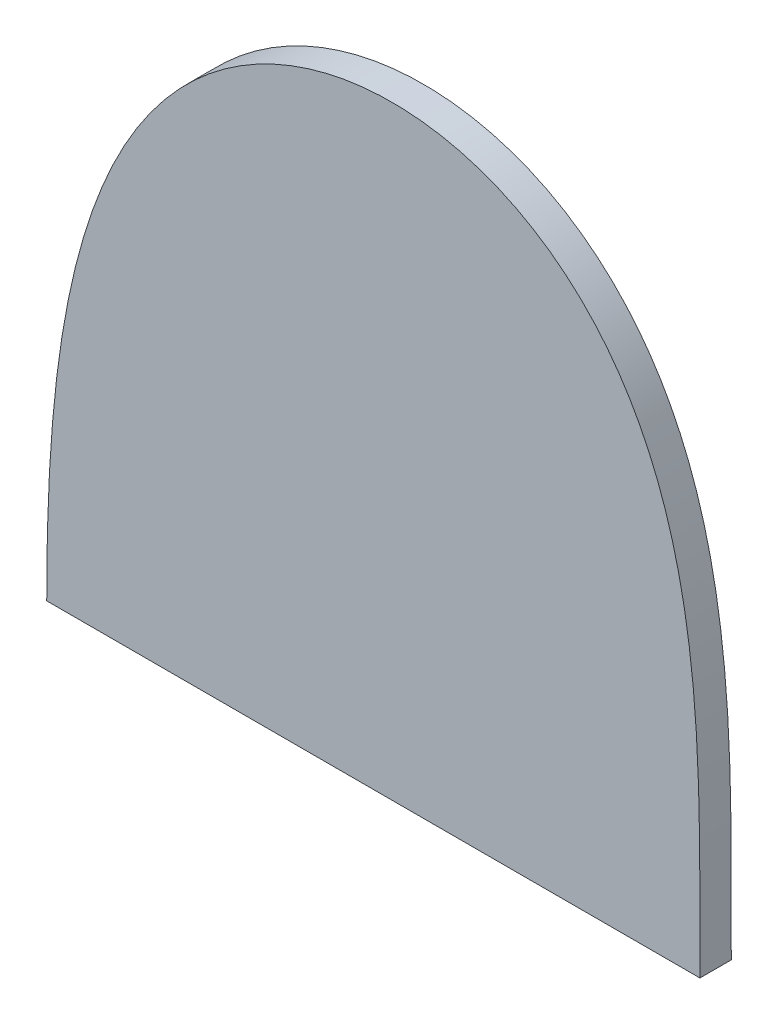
ISO-10303-21;
HEADER;
FILE_DESCRIPTION(('STEP AP214'),'2;1');
FILE_NAME('part.step','',(''),(''),'','','');
FILE_SCHEMA(('AUTOMOTIVE_DESIGN { 1 0 10303 214 1 1 1 1 }'));
ENDSEC;
DATA;
#1=APPLICATION_CONTEXT('core data for automotive mechanical design processes');
#2=APPLICATION_PROTOCOL_DEFINITION('international standard','automotive_design',2000,#1);
#3=PRODUCT_CONTEXT('',#1,'mechanical');
#4=PRODUCT('Part','Part','',(#3));
#5=PRODUCT_RELATED_PRODUCT_CATEGORY('part','',(#4));
#6=PRODUCT_DEFINITION_FORMATION('','',#4);
#7=PRODUCT_DEFINITION_CONTEXT('part definition',#1,'design');
#8=PRODUCT_DEFINITION('design','',#6,#7);
#9=PRODUCT_DEFINITION_SHAPE('','',#8);
#10=(LENGTH_UNIT() NAMED_UNIT(*) SI_UNIT(.MILLI.,.METRE.));
#11=(NAMED_UNIT(*) PLANE_ANGLE_UNIT() SI_UNIT($,.RADIAN.));
#12=(NAMED_UNIT(*) SI_UNIT($,.STERADIAN.) SOLID_ANGLE_UNIT());
#13=UNCERTAINTY_MEASURE_WITH_UNIT(LENGTH_MEASURE(1.E-05),#10,'distance_accuracy_value','');
#14=(GEOMETRIC_REPRESENTATION_CONTEXT(3) GLOBAL_UNCERTAINTY_ASSIGNED_CONTEXT((#13)) GLOBAL_UNIT_ASSIGNED_CONTEXT((#10,
#11,#12)) REPRESENTATION_CONTEXT('',''));
#15=CARTESIAN_POINT('',(0.,0.,0.));
#16=DIRECTION('',(0.,0.,1.));
#17=DIRECTION('',(1.,0.,0.));
#18=AXIS2_PLACEMENT_3D('',#15,#16,#17);
#19=CARTESIAN_POINT('',(19.1800983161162,5.17745356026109,-0.914397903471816));
#20=CARTESIAN_POINT('',(19.1800983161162,12.7102458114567,-0.914397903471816));
#21=CARTESIAN_POINT('',(19.5484411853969,17.6422006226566,-0.914397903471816));
#22=CARTESIAN_POINT('',(12.8300983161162,19.5715823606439,-0.914397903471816));
#23=CARTESIAN_POINT('',(7.67253765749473,17.6422006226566,-0.914397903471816));
#24=CARTESIAN_POINT('',(6.48009831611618,12.7102458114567,-0.914397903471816));
#25=CARTESIAN_POINT('',(6.48009831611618,5.17745356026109,-0.914397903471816));
#26=B_SPLINE_CURVE_WITH_KNOTS('',6,(#19,#20,#21,#22,#23,#24,#25),.UNSPECIFIED.,.F.,.F.,(7,7),
(0.,1.),.UNSPECIFIED.);
#27=DIRECTION('',(0.,0.,1.));
#28=VECTOR('',#27,1.);
#29=SURFACE_OF_LINEAR_EXTRUSION('',#26,#28);
#30=CARTESIAN_POINT('',(19.1800983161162,5.17745356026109,-0.304797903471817));
#31=CARTESIAN_POINT('',(19.1800983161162,12.7102458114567,-0.304797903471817));
#32=CARTESIAN_POINT('',(19.5484411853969,17.6422006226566,-0.304797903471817));
#33=CARTESIAN_POINT('',(12.8300983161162,19.5715823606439,-0.304797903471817));
#34=CARTESIAN_POINT('',(7.67253765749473,17.6422006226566,-0.304797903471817));
#35=CARTESIAN_POINT('',(6.48009831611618,12.7102458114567,-0.304797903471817));
#36=CARTESIAN_POINT('',(6.48009831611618,5.17745356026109,-0.304797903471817));
#37=B_SPLINE_CURVE_WITH_KNOTS('',6,(#30,#31,#32,#33,#34,#35,#36),.UNSPECIFIED.,.F.,.F.,(7,7),
(0.,1.),.UNSPECIFIED.);
#38=CARTESIAN_POINT('',(19.1800983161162,5.17745356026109,-0.304797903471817));
#39=VERTEX_POINT('',#38);
#40=CARTESIAN_POINT('',(6.48009831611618,5.17745356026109,-0.304797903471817));
#41=VERTEX_POINT('',#40);
#42=EDGE_CURVE('E70',#39,#41,#37,.T.);
#43=ORIENTED_EDGE('',*,*,#42,.F.);
#44=DIRECTION('',(0.,0.,1.));
#45=VECTOR('',#44,1.);
#46=CARTESIAN_POINT('',(19.1800983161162,5.17745356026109,-0.914397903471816));
#47=LINE('',#46,#45);
#48=CARTESIAN_POINT('',(19.1800983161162,5.17745356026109,-0.914397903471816));
#49=VERTEX_POINT('',#48);
#50=EDGE_CURVE('E11',#49,#39,#47,.T.);
#51=ORIENTED_EDGE('',*,*,#50,.F.);
#52=CARTESIAN_POINT('',(6.48009831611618,5.17745356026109,-0.914397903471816));
#53=VERTEX_POINT('',#52);
#54=EDGE_CURVE('E74',#49,#53,#26,.T.);
#55=ORIENTED_EDGE('',*,*,#54,.T.);
#56=DIRECTION('',(0.,0.,1.));
#57=VECTOR('',#56,1.);
#58=CARTESIAN_POINT('',(6.48009831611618,5.17745356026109,-0.914397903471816));
#59=LINE('',#58,#57);
#60=EDGE_CURVE('E44',#53,#41,#59,.T.);
#61=ORIENTED_EDGE('',*,*,#60,.T.);
#62=EDGE_LOOP('',(#43,#51,#55,#61));
#63=FACE_BOUND('',#62,.T.);
#64=ADVANCED_FACE('F40',(#63),#29,.T.);
#65=CARTESIAN_POINT('',(6.48009831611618,5.17745356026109,-0.914397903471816));
#66=DIRECTION('',(0.,-1.,0.));
#67=DIRECTION('',(0.,0.,-1.));
#68=AXIS2_PLACEMENT_3D('',#65,#66,#67);
#69=PLANE('',#68);
#70=DIRECTION('',(1.,0.,0.));
#71=VECTOR('',#70,1.);
#72=CARTESIAN_POINT('',(6.48009831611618,5.17745356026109,-0.304797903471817));
#73=LINE('',#72,#71);
#74=EDGE_CURVE('E67',#41,#39,#73,.T.);
#75=ORIENTED_EDGE('',*,*,#74,.F.);
#76=ORIENTED_EDGE('',*,*,#60,.F.);
#77=DIRECTION('',(1.,0.,0.));
#78=VECTOR('',#77,1.);
#79=CARTESIAN_POINT('',(6.48009831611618,5.17745356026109,-0.914397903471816));
#80=LINE('',#79,#78);
#81=EDGE_CURVE('E69',#53,#49,#80,.T.);
#82=ORIENTED_EDGE('',*,*,#81,.T.);
#83=ORIENTED_EDGE('',*,*,#50,.T.);
#84=EDGE_LOOP('',(#75,#76,#82,#83));
#85=FACE_BOUND('',#84,.T.);
#86=ADVANCED_FACE('F65',(#85),#69,.T.);
#87=CARTESIAN_POINT('',(13.1959066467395,16.9308675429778,-0.914397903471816));
#88=DIRECTION('',(0.,0.,1.));
#89=DIRECTION('',(1.,0.,0.));
#90=AXIS2_PLACEMENT_3D('',#87,#88,#89);
#91=PLANE('',#90);
#92=ORIENTED_EDGE('',*,*,#54,.F.);
#93=ORIENTED_EDGE('',*,*,#81,.F.);
#94=EDGE_LOOP('',(#92,#93));
#95=FACE_BOUND('',#94,.T.);
#96=ADVANCED_FACE('F89',(#95),#91,.F.);
#97=CARTESIAN_POINT('',(13.1959066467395,16.9308675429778,-0.304797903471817));
#98=DIRECTION('',(0.,0.,1.));
#99=DIRECTION('',(1.,0.,0.));
#100=AXIS2_PLACEMENT_3D('',#97,#98,#99);
#101=PLANE('',#100);
#102=ORIENTED_EDGE('',*,*,#42,.T.);
#103=ORIENTED_EDGE('',*,*,#74,.T.);
#104=EDGE_LOOP('',(#102,#103));
#105=FACE_BOUND('',#104,.T.);
#106=ADVANCED_FACE('F73',(#105),#101,.T.);
#107=CLOSED_SHELL('',(#64,#86,#96,#106));
#108=MANIFOLD_SOLID_BREP('B2',#107);
#109=ADVANCED_BREP_SHAPE_REPRESENTATION('',(#18,#108),#14);
#110=SHAPE_DEFINITION_REPRESENTATION(#9,#109);
ENDSEC;
END-ISO-10303-21;
